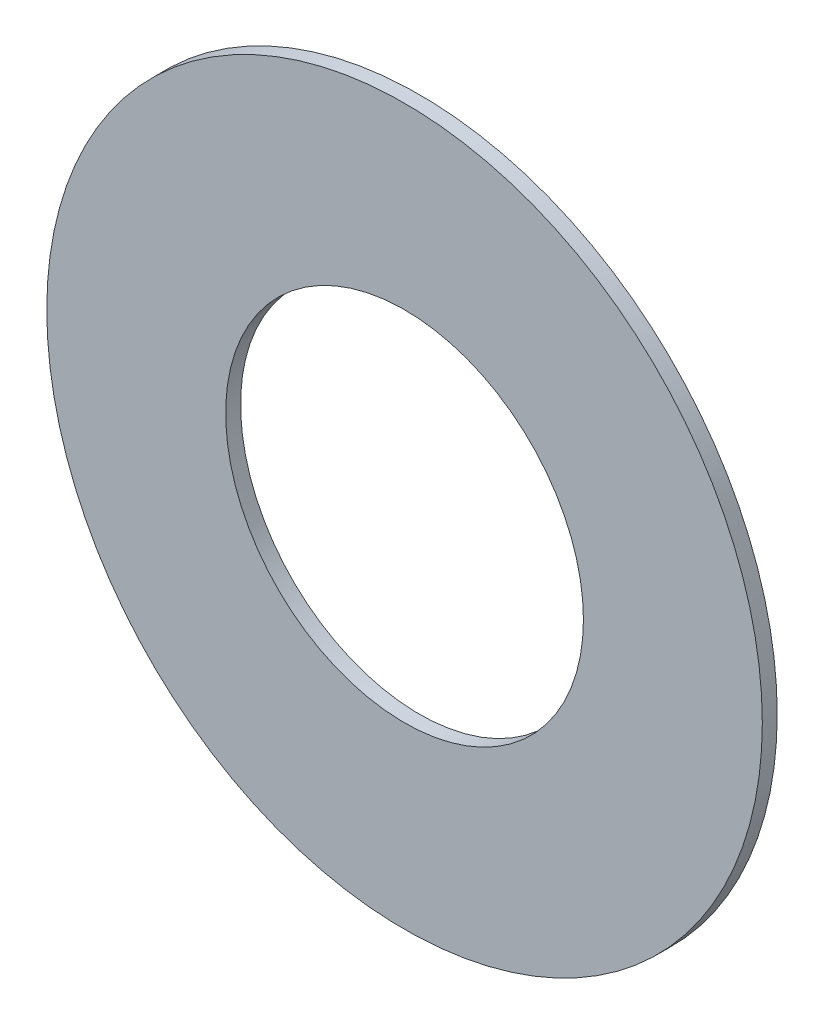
from build123d import *

# Parameters (mm, degrees)
ESQUISSE1_R          = 12
ESQUISSE1_R_2        = 6
BASE_EXTRUSION_DEPTH = 0.5


with BuildPart() as part:
    # Esquisse1 → Base-Extrusion (new body)
    with BuildSketch(Plane.XY):
        Circle(ESQUISSE1_R)
        Circle(ESQUISSE1_R_2, mode=Mode.SUBTRACT)
    extrude(amount=BASE_EXTRUSION_DEPTH)


solid = part.part
